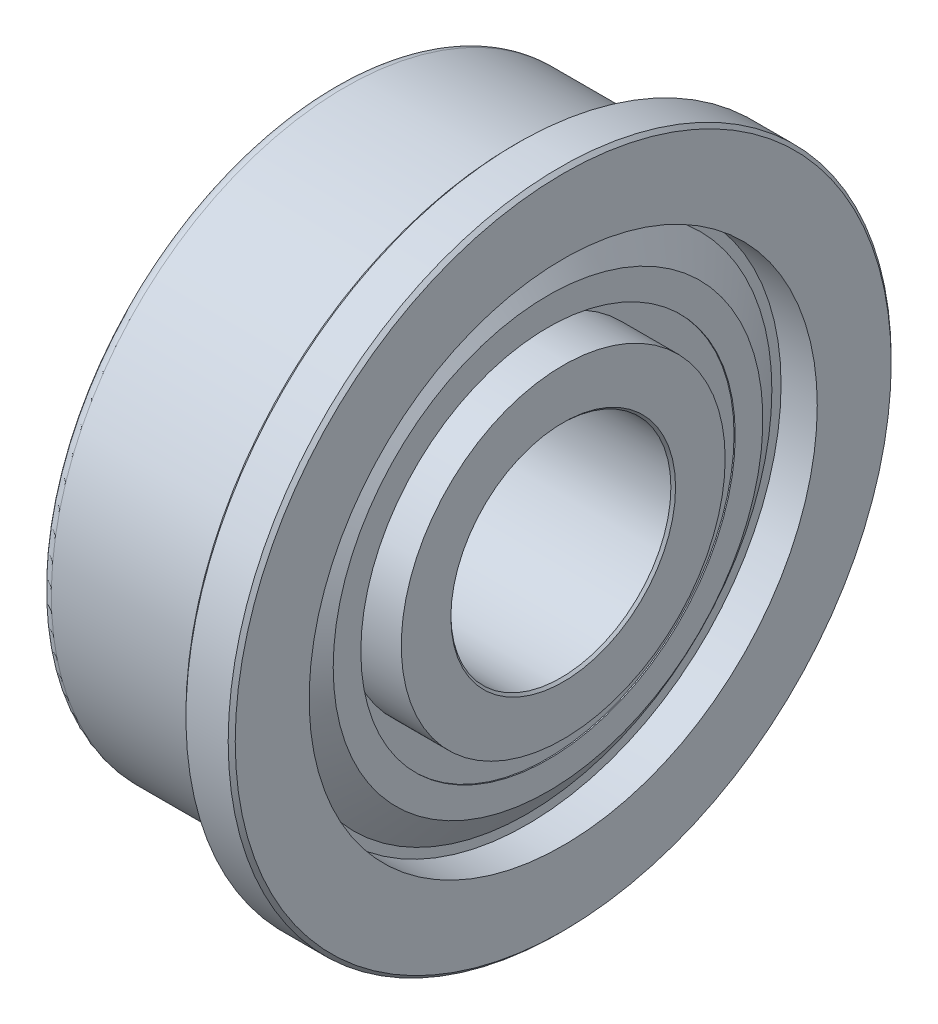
ISO-10303-21;
HEADER;
FILE_DESCRIPTION(('STEP AP214'),'2;1');
FILE_NAME('part.step','',(''),(''),'','','');
FILE_SCHEMA(('AUTOMOTIVE_DESIGN { 1 0 10303 214 1 1 1 1 }'));
ENDSEC;
DATA;
#1=APPLICATION_CONTEXT('core data for automotive mechanical design processes');
#2=APPLICATION_PROTOCOL_DEFINITION('international standard','automotive_design',2000,#1);
#3=PRODUCT_CONTEXT('',#1,'mechanical');
#4=PRODUCT('Part','Part','',(#3));
#5=PRODUCT_RELATED_PRODUCT_CATEGORY('part','',(#4));
#6=PRODUCT_DEFINITION_FORMATION('','',#4);
#7=PRODUCT_DEFINITION_CONTEXT('part definition',#1,'design');
#8=PRODUCT_DEFINITION('design','',#6,#7);
#9=PRODUCT_DEFINITION_SHAPE('','',#8);
#10=(LENGTH_UNIT() NAMED_UNIT(*) SI_UNIT(.MILLI.,.METRE.));
#11=(NAMED_UNIT(*) PLANE_ANGLE_UNIT() SI_UNIT($,.RADIAN.));
#12=(NAMED_UNIT(*) SI_UNIT($,.STERADIAN.) SOLID_ANGLE_UNIT());
#13=UNCERTAINTY_MEASURE_WITH_UNIT(LENGTH_MEASURE(1.E-05),#10,'distance_accuracy_value','');
#14=(GEOMETRIC_REPRESENTATION_CONTEXT(3) GLOBAL_UNCERTAINTY_ASSIGNED_CONTEXT((#13)) GLOBAL_UNIT_ASSIGNED_CONTEXT((#10,
#11,#12)) REPRESENTATION_CONTEXT('',''));
#15=CARTESIAN_POINT('',(0.,0.,0.));
#16=DIRECTION('',(0.,0.,1.));
#17=DIRECTION('',(1.,0.,0.));
#18=AXIS2_PLACEMENT_3D('',#15,#16,#17);
#19=CARTESIAN_POINT('',(2.48919999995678,0.,0.));
#20=DIRECTION('',(1.,0.,0.));
#21=DIRECTION('',(0.,0.,-1.));
#22=AXIS2_PLACEMENT_3D('',#19,#20,#21);
#23=CONICAL_SURFACE('',#22,2.43205000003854,0.785398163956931);
#24=CARTESIAN_POINT('',(2.48919999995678,0.,0.));
#25=DIRECTION('',(1.,0.,0.));
#26=DIRECTION('',(0.,0.,-1.));
#27=AXIS2_PLACEMENT_3D('',#24,#25,#26);
#28=CIRCLE('',#27,2.43205000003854);
#29=CARTESIAN_POINT('',(2.48919999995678,0.,-2.43205000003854));
#30=VERTEX_POINT('',#29);
#31=EDGE_CURVE('E47',#30,#30,#28,.F.);
#32=ORIENTED_EDGE('',*,*,#31,.F.);
#33=EDGE_LOOP('',(#32));
#34=FACE_BOUND('',#33,.T.);
#35=CARTESIAN_POINT('',(2.4384,0.,0.));
#36=DIRECTION('',(1.,0.,0.));
#37=DIRECTION('',(0.,0.,-1.));
#38=AXIS2_PLACEMENT_3D('',#35,#36,#37);
#39=CIRCLE('',#38,2.38125);
#40=CARTESIAN_POINT('',(2.4384,0.,-2.38125));
#41=VERTEX_POINT('',#40);
#42=EDGE_CURVE('E50',#41,#41,#39,.F.);
#43=ORIENTED_EDGE('',*,*,#42,.T.);
#44=EDGE_LOOP('',(#43));
#45=FACE_BOUND('',#44,.T.);
#46=ADVANCED_FACE('F16',(#34,#45),#23,.F.);
#47=CARTESIAN_POINT('',(2.4892,0.,0.));
#48=DIRECTION('',(1.,0.,0.));
#49=DIRECTION('',(0.,0.,-1.));
#50=AXIS2_PLACEMENT_3D('',#47,#48,#49);
#51=PLANE('',#50);
#52=ORIENTED_EDGE('',*,*,#31,.T.);
#53=EDGE_LOOP('',(#52));
#54=FACE_BOUND('',#53,.T.);
#55=CARTESIAN_POINT('',(2.4892,0.,0.));
#56=DIRECTION('',(1.,0.,0.));
#57=DIRECTION('',(0.,0.,-1.));
#58=AXIS2_PLACEMENT_3D('',#55,#56,#57);
#59=CIRCLE('',#58,3.5052);
#60=CARTESIAN_POINT('',(2.4892,0.,-3.5052));
#61=VERTEX_POINT('',#60);
#62=EDGE_CURVE('E51',#61,#61,#59,.F.);
#63=ORIENTED_EDGE('',*,*,#62,.F.);
#64=EDGE_LOOP('',(#63));
#65=FACE_BOUND('',#64,.T.);
#66=ADVANCED_FACE('F290',(#54,#65),#51,.T.);
#67=CARTESIAN_POINT('',(-2.73812,0.,0.));
#68=DIRECTION('',(1.,0.,0.));
#69=DIRECTION('',(0.,0.,-1.));
#70=AXIS2_PLACEMENT_3D('',#67,#68,#69);
#71=CYLINDRICAL_SURFACE('',#70,2.38125);
#72=ORIENTED_EDGE('',*,*,#42,.F.);
#73=EDGE_LOOP('',(#72));
#74=FACE_BOUND('',#73,.T.);
#75=CARTESIAN_POINT('',(-2.43839999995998,0.,0.));
#76=DIRECTION('',(-1.,0.,0.));
#77=DIRECTION('',(0.,1.,0.));
#78=AXIS2_PLACEMENT_3D('',#75,#76,#77);
#79=CIRCLE('',#78,2.3812499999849);
#80=CARTESIAN_POINT('',(-2.43839999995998,2.3812499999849,0.));
#81=VERTEX_POINT('',#80);
#82=EDGE_CURVE('E54',#81,#81,#79,.T.);
#83=ORIENTED_EDGE('',*,*,#82,.T.);
#84=EDGE_LOOP('',(#83));
#85=FACE_BOUND('',#84,.T.);
#86=ADVANCED_FACE('F287',(#74,#85),#71,.F.);
#87=CARTESIAN_POINT('',(-2.73812,0.,0.));
#88=DIRECTION('',(1.,0.,0.));
#89=DIRECTION('',(0.,0.,-1.));
#90=AXIS2_PLACEMENT_3D('',#87,#88,#89);
#91=CYLINDRICAL_SURFACE('',#90,3.5052);
#92=CARTESIAN_POINT('',(1.2446,0.,0.));
#93=DIRECTION('',(1.,0.,0.));
#94=DIRECTION('',(0.,0.,-1.));
#95=AXIS2_PLACEMENT_3D('',#92,#93,#94);
#96=CIRCLE('',#95,3.5052);
#97=CARTESIAN_POINT('',(1.2446,0.,-3.5052));
#98=VERTEX_POINT('',#97);
#99=EDGE_CURVE('E55',#98,#98,#96,.F.);
#100=ORIENTED_EDGE('',*,*,#99,.F.);
#101=EDGE_LOOP('',(#100));
#102=FACE_BOUND('',#101,.T.);
#103=ORIENTED_EDGE('',*,*,#62,.T.);
#104=EDGE_LOOP('',(#103));
#105=FACE_BOUND('',#104,.T.);
#106=ADVANCED_FACE('F283',(#102,#105),#91,.T.);
#107=CARTESIAN_POINT('',(-2.48919999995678,0.,0.));
#108=DIRECTION('',(-1.,0.,0.));
#109=DIRECTION('',(0.,0.,1.));
#110=AXIS2_PLACEMENT_3D('',#107,#108,#109);
#111=CONICAL_SURFACE('',#110,2.43205000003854,0.785398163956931);
#112=ORIENTED_EDGE('',*,*,#82,.F.);
#113=EDGE_LOOP('',(#112));
#114=FACE_BOUND('',#113,.T.);
#115=CARTESIAN_POINT('',(-2.48919999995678,0.,0.));
#116=DIRECTION('',(-1.,0.,0.));
#117=DIRECTION('',(0.,0.,1.));
#118=AXIS2_PLACEMENT_3D('',#115,#116,#117);
#119=CIRCLE('',#118,2.43205000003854);
#120=CARTESIAN_POINT('',(-2.48919999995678,0.,2.43205000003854));
#121=VERTEX_POINT('',#120);
#122=EDGE_CURVE('E58',#121,#121,#119,.T.);
#123=ORIENTED_EDGE('',*,*,#122,.T.);
#124=EDGE_LOOP('',(#123));
#125=FACE_BOUND('',#124,.T.);
#126=ADVANCED_FACE('F279',(#114,#125),#111,.F.);
#127=CARTESIAN_POINT('',(1.2446,0.,0.));
#128=DIRECTION('',(1.,0.,0.));
#129=DIRECTION('',(0.,0.,-1.));
#130=AXIS2_PLACEMENT_3D('',#127,#128,#129);
#131=PLANE('',#130);
#132=ORIENTED_EDGE('',*,*,#99,.T.);
#133=EDGE_LOOP('',(#132));
#134=FACE_BOUND('',#133,.T.);
#135=CARTESIAN_POINT('',(1.2446,0.,0.));
#136=DIRECTION('',(1.,0.,0.));
#137=DIRECTION('',(0.,0.,-1.));
#138=AXIS2_PLACEMENT_3D('',#135,#136,#137);
#139=CIRCLE('',#138,5.4991);
#140=CARTESIAN_POINT('',(1.2446,0.,-5.4991));
#141=VERTEX_POINT('',#140);
#142=EDGE_CURVE('E61',#141,#141,#139,.T.);
#143=ORIENTED_EDGE('',*,*,#142,.T.);
#144=EDGE_LOOP('',(#143));
#145=FACE_BOUND('',#144,.T.);
#146=ADVANCED_FACE('F275',(#134,#145),#131,.T.);
#147=CARTESIAN_POINT('',(-2.4892,0.,0.));
#148=DIRECTION('',(1.,0.,0.));
#149=DIRECTION('',(0.,0.,-1.));
#150=AXIS2_PLACEMENT_3D('',#147,#148,#149);
#151=PLANE('',#150);
#152=ORIENTED_EDGE('',*,*,#122,.F.);
#153=EDGE_LOOP('',(#152));
#154=FACE_BOUND('',#153,.T.);
#155=CARTESIAN_POINT('',(-2.4892,0.,0.));
#156=DIRECTION('',(1.,0.,0.));
#157=DIRECTION('',(0.,0.,-1.));
#158=AXIS2_PLACEMENT_3D('',#155,#156,#157);
#159=CIRCLE('',#158,3.5052);
#160=CARTESIAN_POINT('',(-2.4892,0.,-3.5052));
#161=VERTEX_POINT('',#160);
#162=EDGE_CURVE('E64',#161,#161,#159,.T.);
#163=ORIENTED_EDGE('',*,*,#162,.F.);
#164=EDGE_LOOP('',(#163));
#165=FACE_BOUND('',#164,.T.);
#166=ADVANCED_FACE('F271',(#154,#165),#151,.F.);
#167=CARTESIAN_POINT('',(-2.73812,0.,0.));
#168=DIRECTION('',(1.,0.,0.));
#169=DIRECTION('',(0.,0.,-1.));
#170=AXIS2_PLACEMENT_3D('',#167,#168,#169);
#171=CYLINDRICAL_SURFACE('',#170,5.4991);
#172=ORIENTED_EDGE('',*,*,#142,.F.);
#173=EDGE_LOOP('',(#172));
#174=FACE_BOUND('',#173,.T.);
#175=CARTESIAN_POINT('',(1.68021,0.,0.));
#176=DIRECTION('',(1.,0.,0.));
#177=DIRECTION('',(0.,0.,-1.));
#178=AXIS2_PLACEMENT_3D('',#175,#176,#177);
#179=CIRCLE('',#178,5.4991);
#180=CARTESIAN_POINT('',(1.68021,0.,-5.4991));
#181=VERTEX_POINT('',#180);
#182=EDGE_CURVE('E67',#181,#181,#179,.T.);
#183=ORIENTED_EDGE('',*,*,#182,.T.);
#184=EDGE_LOOP('',(#183));
#185=FACE_BOUND('',#184,.T.);
#186=ADVANCED_FACE('F267',(#174,#185),#171,.F.);
#187=CARTESIAN_POINT('',(-2.73812,0.,0.));
#188=DIRECTION('',(1.,0.,0.));
#189=DIRECTION('',(0.,0.,-1.));
#190=AXIS2_PLACEMENT_3D('',#187,#188,#189);
#191=CYLINDRICAL_SURFACE('',#190,3.5052);
#192=ORIENTED_EDGE('',*,*,#162,.T.);
#193=EDGE_LOOP('',(#192));
#194=FACE_BOUND('',#193,.T.);
#195=CARTESIAN_POINT('',(-1.2446,0.,0.));
#196=DIRECTION('',(1.,0.,0.));
#197=DIRECTION('',(0.,0.,-1.));
#198=AXIS2_PLACEMENT_3D('',#195,#196,#197);
#199=CIRCLE('',#198,3.5052);
#200=CARTESIAN_POINT('',(-1.2446,0.,-3.5052));
#201=VERTEX_POINT('',#200);
#202=EDGE_CURVE('E70',#201,#201,#199,.F.);
#203=ORIENTED_EDGE('',*,*,#202,.T.);
#204=EDGE_LOOP('',(#203));
#205=FACE_BOUND('',#204,.T.);
#206=ADVANCED_FACE('F263',(#194,#205),#191,.T.);
#207=CARTESIAN_POINT('',(1.68021,0.,0.));
#208=DIRECTION('',(1.,0.,0.));
#209=DIRECTION('',(0.,0.,-1.));
#210=AXIS2_PLACEMENT_3D('',#207,#208,#209);
#211=PLANE('',#210);
#212=CARTESIAN_POINT('',(1.68021000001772,0.,0.));
#213=DIRECTION('',(-1.,0.,0.));
#214=DIRECTION('',(0.,0.,1.));
#215=AXIS2_PLACEMENT_3D('',#212,#213,#214);
#216=CIRCLE('',#215,5.29170141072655);
#217=CARTESIAN_POINT('',(1.68021000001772,0.,5.29170141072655));
#218=VERTEX_POINT('',#217);
#219=EDGE_CURVE('E73',#218,#218,#216,.F.);
#220=ORIENTED_EDGE('',*,*,#219,.T.);
#221=EDGE_LOOP('',(#220));
#222=FACE_BOUND('',#221,.T.);
#223=ORIENTED_EDGE('',*,*,#182,.F.);
#224=EDGE_LOOP('',(#223));
#225=FACE_BOUND('',#224,.T.);
#226=ADVANCED_FACE('F259',(#222,#225),#211,.F.);
#227=CARTESIAN_POINT('',(-1.2446,0.,0.));
#228=DIRECTION('',(1.,0.,0.));
#229=DIRECTION('',(0.,0.,-1.));
#230=AXIS2_PLACEMENT_3D('',#227,#228,#229);
#231=PLANE('',#230);
#232=ORIENTED_EDGE('',*,*,#202,.F.);
#233=EDGE_LOOP('',(#232));
#234=FACE_BOUND('',#233,.T.);
#235=CARTESIAN_POINT('',(-1.2446,0.,0.));
#236=DIRECTION('',(1.,0.,0.));
#237=DIRECTION('',(0.,0.,-1.));
#238=AXIS2_PLACEMENT_3D('',#235,#236,#237);
#239=CIRCLE('',#238,5.4991);
#240=CARTESIAN_POINT('',(-1.2446,0.,-5.4991));
#241=VERTEX_POINT('',#240);
#242=EDGE_CURVE('E76',#241,#241,#239,.F.);
#243=ORIENTED_EDGE('',*,*,#242,.T.);
#244=EDGE_LOOP('',(#243));
#245=FACE_BOUND('',#244,.T.);
#246=ADVANCED_FACE('F255',(#234,#245),#231,.F.);
#247=CARTESIAN_POINT('',(1.68021000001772,0.,0.));
#248=DIRECTION('',(-1.,0.,0.));
#249=DIRECTION('',(0.,0.,1.));
#250=AXIS2_PLACEMENT_3D('',#247,#248,#249);
#251=CONICAL_SURFACE('',#250,5.29170141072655,0.959931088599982);
#252=ORIENTED_EDGE('',*,*,#219,.F.);
#253=EDGE_LOOP('',(#252));
#254=FACE_BOUND('',#253,.T.);
#255=CARTESIAN_POINT('',(2.1350683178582,0.,0.));
#256=DIRECTION('',(-1.,0.,0.));
#257=DIRECTION('',(0.,0.,1.));
#258=AXIS2_PLACEMENT_3D('',#255,#256,#257);
#259=CIRCLE('',#258,4.64209641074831);
#260=CARTESIAN_POINT('',(2.1350683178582,0.,4.64209641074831));
#261=VERTEX_POINT('',#260);
#262=EDGE_CURVE('E79',#261,#261,#259,.F.);
#263=ORIENTED_EDGE('',*,*,#262,.T.);
#264=EDGE_LOOP('',(#263));
#265=FACE_BOUND('',#264,.T.);
#266=ADVANCED_FACE('F251',(#254,#265),#251,.F.);
#267=CARTESIAN_POINT('',(-2.73812,0.,0.));
#268=DIRECTION('',(1.,0.,0.));
#269=DIRECTION('',(0.,0.,-1.));
#270=AXIS2_PLACEMENT_3D('',#267,#268,#269);
#271=CYLINDRICAL_SURFACE('',#270,5.4991);
#272=ORIENTED_EDGE('',*,*,#242,.F.);
#273=EDGE_LOOP('',(#272));
#274=FACE_BOUND('',#273,.T.);
#275=CARTESIAN_POINT('',(-1.68021,0.,0.));
#276=DIRECTION('',(1.,0.,0.));
#277=DIRECTION('',(0.,0.,-1.));
#278=AXIS2_PLACEMENT_3D('',#275,#276,#277);
#279=CIRCLE('',#278,5.4991);
#280=CARTESIAN_POINT('',(-1.68021,0.,-5.4991));
#281=VERTEX_POINT('',#280);
#282=EDGE_CURVE('E82',#281,#281,#279,.T.);
#283=ORIENTED_EDGE('',*,*,#282,.F.);
#284=EDGE_LOOP('',(#283));
#285=FACE_BOUND('',#284,.T.);
#286=ADVANCED_FACE('F247',(#274,#285),#271,.F.);
#287=CARTESIAN_POINT('',(2.13506831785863,0.,0.));
#288=DIRECTION('',(1.,0.,0.));
#289=DIRECTION('',(0.,0.,-1.));
#290=AXIS2_PLACEMENT_3D('',#287,#288,#289);
#291=PLANE('',#290);
#292=CARTESIAN_POINT('',(2.13506831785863,0.,0.));
#293=DIRECTION('',(1.,0.,0.));
#294=DIRECTION('',(0.,0.,-1.));
#295=AXIS2_PLACEMENT_3D('',#292,#293,#294);
#296=CIRCLE('',#295,4.051935);
#297=CARTESIAN_POINT('',(2.13506831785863,0.,-4.051935));
#298=VERTEX_POINT('',#297);
#299=EDGE_CURVE('E85',#298,#298,#296,.T.);
#300=ORIENTED_EDGE('',*,*,#299,.T.);
#301=EDGE_LOOP('',(#300));
#302=FACE_BOUND('',#301,.T.);
#303=ORIENTED_EDGE('',*,*,#262,.F.);
#304=EDGE_LOOP('',(#303));
#305=FACE_BOUND('',#304,.T.);
#306=ADVANCED_FACE('F243',(#302,#305),#291,.F.);
#307=CARTESIAN_POINT('',(-1.68021,0.,0.));
#308=DIRECTION('',(1.,0.,0.));
#309=DIRECTION('',(0.,0.,-1.));
#310=AXIS2_PLACEMENT_3D('',#307,#308,#309);
#311=PLANE('',#310);
#312=CARTESIAN_POINT('',(-1.68021000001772,0.,0.));
#313=DIRECTION('',(1.,0.,0.));
#314=DIRECTION('',(0.,0.,-1.));
#315=AXIS2_PLACEMENT_3D('',#312,#313,#314);
#316=CIRCLE('',#315,5.29170141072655);
#317=CARTESIAN_POINT('',(-1.68021000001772,0.,-5.29170141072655));
#318=VERTEX_POINT('',#317);
#319=EDGE_CURVE('E88',#318,#318,#316,.F.);
#320=ORIENTED_EDGE('',*,*,#319,.T.);
#321=EDGE_LOOP('',(#320));
#322=FACE_BOUND('',#321,.T.);
#323=ORIENTED_EDGE('',*,*,#282,.T.);
#324=EDGE_LOOP('',(#323));
#325=FACE_BOUND('',#324,.T.);
#326=ADVANCED_FACE('F239',(#322,#325),#311,.T.);
#327=CARTESIAN_POINT('',(1.65619708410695,0.,0.));
#328=DIRECTION('',(1.,0.,0.));
#329=DIRECTION('',(0.,0.,-1.));
#330=AXIS2_PLACEMENT_3D('',#327,#328,#329);
#331=CYLINDRICAL_SURFACE('',#330,4.051935);
#332=CARTESIAN_POINT('',(2.16046831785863,0.,0.));
#333=DIRECTION('',(1.,0.,0.));
#334=DIRECTION('',(0.,0.,-1.));
#335=AXIS2_PLACEMENT_3D('',#332,#333,#334);
#336=CIRCLE('',#335,4.051935);
#337=CARTESIAN_POINT('',(2.16046831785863,0.,-4.051935));
#338=VERTEX_POINT('',#337);
#339=EDGE_CURVE('E91',#338,#338,#336,.F.);
#340=ORIENTED_EDGE('',*,*,#339,.F.);
#341=EDGE_LOOP('',(#340));
#342=FACE_BOUND('',#341,.T.);
#343=ORIENTED_EDGE('',*,*,#299,.F.);
#344=EDGE_LOOP('',(#343));
#345=FACE_BOUND('',#344,.T.);
#346=ADVANCED_FACE('F235',(#342,#345),#331,.F.);
#347=CARTESIAN_POINT('',(-1.68021000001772,0.,0.));
#348=DIRECTION('',(1.,0.,0.));
#349=DIRECTION('',(0.,0.,-1.));
#350=AXIS2_PLACEMENT_3D('',#347,#348,#349);
#351=CONICAL_SURFACE('',#350,5.29170141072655,0.959931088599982);
#352=ORIENTED_EDGE('',*,*,#319,.F.);
#353=EDGE_LOOP('',(#352));
#354=FACE_BOUND('',#353,.T.);
#355=CARTESIAN_POINT('',(-2.1350683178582,0.,0.));
#356=DIRECTION('',(1.,0.,0.));
#357=DIRECTION('',(0.,0.,-1.));
#358=AXIS2_PLACEMENT_3D('',#355,#356,#357);
#359=CIRCLE('',#358,4.64209641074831);
#360=CARTESIAN_POINT('',(-2.1350683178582,0.,-4.64209641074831));
#361=VERTEX_POINT('',#360);
#362=EDGE_CURVE('E94',#361,#361,#359,.T.);
#363=ORIENTED_EDGE('',*,*,#362,.F.);
#364=EDGE_LOOP('',(#363));
#365=FACE_BOUND('',#364,.T.);
#366=ADVANCED_FACE('F231',(#354,#365),#351,.F.);
#367=CARTESIAN_POINT('',(2.16046831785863,0.,0.));
#368=DIRECTION('',(1.,0.,0.));
#369=DIRECTION('',(0.,0.,-1.));
#370=AXIS2_PLACEMENT_3D('',#367,#368,#369);
#371=PLANE('',#370);
#372=ORIENTED_EDGE('',*,*,#339,.T.);
#373=EDGE_LOOP('',(#372));
#374=FACE_BOUND('',#373,.T.);
#375=CARTESIAN_POINT('',(2.16046831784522,0.,0.));
#376=DIRECTION('',(-1.,0.,0.));
#377=DIRECTION('',(0.,0.,1.));
#378=AXIS2_PLACEMENT_3D('',#375,#376,#377);
#379=CIRCLE('',#378,4.65010500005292);
#380=CARTESIAN_POINT('',(2.16046831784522,0.,4.65010500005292));
#381=VERTEX_POINT('',#380);
#382=EDGE_CURVE('E97',#381,#381,#379,.T.);
#383=ORIENTED_EDGE('',*,*,#382,.F.);
#384=EDGE_LOOP('',(#383));
#385=FACE_BOUND('',#384,.T.);
#386=ADVANCED_FACE('F227',(#374,#385),#371,.T.);
#387=CARTESIAN_POINT('',(-2.13506831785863,0.,0.));
#388=DIRECTION('',(1.,0.,0.));
#389=DIRECTION('',(0.,0.,-1.));
#390=AXIS2_PLACEMENT_3D('',#387,#388,#389);
#391=PLANE('',#390);
#392=CARTESIAN_POINT('',(-2.13506831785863,0.,0.));
#393=DIRECTION('',(1.,0.,0.));
#394=DIRECTION('',(0.,0.,-1.));
#395=AXIS2_PLACEMENT_3D('',#392,#393,#394);
#396=CIRCLE('',#395,4.051935);
#397=CARTESIAN_POINT('',(-2.13506831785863,0.,-4.051935));
#398=VERTEX_POINT('',#397);
#399=EDGE_CURVE('E100',#398,#398,#396,.F.);
#400=ORIENTED_EDGE('',*,*,#399,.T.);
#401=EDGE_LOOP('',(#400));
#402=FACE_BOUND('',#401,.T.);
#403=ORIENTED_EDGE('',*,*,#362,.T.);
#404=EDGE_LOOP('',(#403));
#405=FACE_BOUND('',#404,.T.);
#406=ADVANCED_FACE('F223',(#402,#405),#391,.T.);
#407=CARTESIAN_POINT('',(1.70561000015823,0.,0.));
#408=DIRECTION('',(-1.,0.,0.));
#409=DIRECTION('',(0.,0.,1.));
#410=AXIS2_PLACEMENT_3D('',#407,#408,#409);
#411=CONICAL_SURFACE('',#410,5.29970999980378,0.959931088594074);
#412=CARTESIAN_POINT('',(1.70561000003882,0.,0.));
#413=DIRECTION('',(-1.,0.,0.));
#414=DIRECTION('',(0.,0.,1.));
#415=AXIS2_PLACEMENT_3D('',#412,#413,#414);
#416=CIRCLE('',#415,5.29970999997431);
#417=CARTESIAN_POINT('',(1.70561000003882,0.,5.29970999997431));
#418=VERTEX_POINT('',#417);
#419=EDGE_CURVE('E103',#418,#418,#416,.T.);
#420=ORIENTED_EDGE('',*,*,#419,.F.);
#421=EDGE_LOOP('',(#420));
#422=FACE_BOUND('',#421,.T.);
#423=ORIENTED_EDGE('',*,*,#382,.T.);
#424=EDGE_LOOP('',(#423));
#425=FACE_BOUND('',#424,.T.);
#426=ADVANCED_FACE('F219',(#422,#425),#411,.T.);
#427=CARTESIAN_POINT('',(-1.65619708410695,0.,0.));
#428=DIRECTION('',(1.,0.,0.));
#429=DIRECTION('',(0.,0.,-1.));
#430=AXIS2_PLACEMENT_3D('',#427,#428,#429);
#431=CYLINDRICAL_SURFACE('',#430,4.051935);
#432=CARTESIAN_POINT('',(-2.16046831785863,0.,0.));
#433=DIRECTION('',(1.,0.,0.));
#434=DIRECTION('',(0.,0.,-1.));
#435=AXIS2_PLACEMENT_3D('',#432,#433,#434);
#436=CIRCLE('',#435,4.051935);
#437=CARTESIAN_POINT('',(-2.16046831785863,0.,-4.051935));
#438=VERTEX_POINT('',#437);
#439=EDGE_CURVE('E106',#438,#438,#436,.F.);
#440=ORIENTED_EDGE('',*,*,#439,.T.);
#441=EDGE_LOOP('',(#440));
#442=FACE_BOUND('',#441,.T.);
#443=ORIENTED_EDGE('',*,*,#399,.F.);
#444=EDGE_LOOP('',(#443));
#445=FACE_BOUND('',#444,.T.);
#446=ADVANCED_FACE('F215',(#442,#445),#431,.F.);
#447=CARTESIAN_POINT('',(1.70561,0.,0.));
#448=DIRECTION('',(1.,0.,0.));
#449=DIRECTION('',(0.,0.,-1.));
#450=AXIS2_PLACEMENT_3D('',#447,#448,#449);
#451=PLANE('',#450);
#452=ORIENTED_EDGE('',*,*,#419,.T.);
#453=EDGE_LOOP('',(#452));
#454=FACE_BOUND('',#453,.T.);
#455=CARTESIAN_POINT('',(1.70561,0.,0.));
#456=DIRECTION('',(1.,0.,0.));
#457=DIRECTION('',(0.,0.,-1.));
#458=AXIS2_PLACEMENT_3D('',#455,#456,#457);
#459=CIRCLE('',#458,5.4991);
#460=CARTESIAN_POINT('',(1.70561,0.,-5.4991));
#461=VERTEX_POINT('',#460);
#462=EDGE_CURVE('E109',#461,#461,#459,.T.);
#463=ORIENTED_EDGE('',*,*,#462,.T.);
#464=EDGE_LOOP('',(#463));
#465=FACE_BOUND('',#464,.T.);
#466=ADVANCED_FACE('F211',(#454,#465),#451,.T.);
#467=CARTESIAN_POINT('',(-2.16046831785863,0.,0.));
#468=DIRECTION('',(1.,0.,0.));
#469=DIRECTION('',(0.,0.,-1.));
#470=AXIS2_PLACEMENT_3D('',#467,#468,#469);
#471=PLANE('',#470);
#472=ORIENTED_EDGE('',*,*,#439,.F.);
#473=EDGE_LOOP('',(#472));
#474=FACE_BOUND('',#473,.T.);
#475=CARTESIAN_POINT('',(-2.16046831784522,0.,0.));
#476=DIRECTION('',(1.,0.,0.));
#477=DIRECTION('',(0.,0.,-1.));
#478=AXIS2_PLACEMENT_3D('',#475,#476,#477);
#479=CIRCLE('',#478,4.65010500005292);
#480=CARTESIAN_POINT('',(-2.16046831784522,0.,-4.65010500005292));
#481=VERTEX_POINT('',#480);
#482=EDGE_CURVE('E112',#481,#481,#479,.T.);
#483=ORIENTED_EDGE('',*,*,#482,.F.);
#484=EDGE_LOOP('',(#483));
#485=FACE_BOUND('',#484,.T.);
#486=ADVANCED_FACE('F207',(#474,#485),#471,.F.);
#487=CARTESIAN_POINT('',(-2.73812,0.,0.));
#488=DIRECTION('',(1.,0.,0.));
#489=DIRECTION('',(0.,0.,-1.));
#490=AXIS2_PLACEMENT_3D('',#487,#488,#489);
#491=CYLINDRICAL_SURFACE('',#490,5.4991);
#492=CARTESIAN_POINT('',(2.4892,0.,0.));
#493=DIRECTION('',(1.,0.,0.));
#494=DIRECTION('',(0.,0.,-1.));
#495=AXIS2_PLACEMENT_3D('',#492,#493,#494);
#496=CIRCLE('',#495,5.4991);
#497=CARTESIAN_POINT('',(2.4892,0.,-5.4991));
#498=VERTEX_POINT('',#497);
#499=EDGE_CURVE('E115',#498,#498,#496,.F.);
#500=ORIENTED_EDGE('',*,*,#499,.F.);
#501=EDGE_LOOP('',(#500));
#502=FACE_BOUND('',#501,.T.);
#503=ORIENTED_EDGE('',*,*,#462,.F.);
#504=EDGE_LOOP('',(#503));
#505=FACE_BOUND('',#504,.T.);
#506=ADVANCED_FACE('F203',(#502,#505),#491,.F.);
#507=CARTESIAN_POINT('',(-1.70561000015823,0.,0.));
#508=DIRECTION('',(1.,0.,0.));
#509=DIRECTION('',(0.,0.,-1.));
#510=AXIS2_PLACEMENT_3D('',#507,#508,#509);
#511=CONICAL_SURFACE('',#510,5.29970999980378,0.959931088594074);
#512=CARTESIAN_POINT('',(-1.70561000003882,0.,0.));
#513=DIRECTION('',(1.,0.,0.));
#514=DIRECTION('',(0.,0.,-1.));
#515=AXIS2_PLACEMENT_3D('',#512,#513,#514);
#516=CIRCLE('',#515,5.29970999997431);
#517=CARTESIAN_POINT('',(-1.70561000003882,0.,-5.29970999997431));
#518=VERTEX_POINT('',#517);
#519=EDGE_CURVE('E118',#518,#518,#516,.F.);
#520=ORIENTED_EDGE('',*,*,#519,.T.);
#521=EDGE_LOOP('',(#520));
#522=FACE_BOUND('',#521,.T.);
#523=ORIENTED_EDGE('',*,*,#482,.T.);
#524=EDGE_LOOP('',(#523));
#525=FACE_BOUND('',#524,.T.);
#526=ADVANCED_FACE('F199',(#522,#525),#511,.T.);
#527=CARTESIAN_POINT('',(2.4892,0.,0.));
#528=DIRECTION('',(1.,0.,0.));
#529=DIRECTION('',(0.,0.,-1.));
#530=AXIS2_PLACEMENT_3D('',#527,#528,#529);
#531=PLANE('',#530);
#532=ORIENTED_EDGE('',*,*,#499,.T.);
#533=EDGE_LOOP('',(#532));
#534=FACE_BOUND('',#533,.T.);
#535=CARTESIAN_POINT('',(2.48920000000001,0.,0.));
#536=DIRECTION('',(-1.,0.,0.));
#537=DIRECTION('',(0.,0.,1.));
#538=AXIS2_PLACEMENT_3D('',#535,#536,#537);
#539=CIRCLE('',#538,7.09930000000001);
#540=CARTESIAN_POINT('',(2.48920000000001,0.,7.09930000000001));
#541=VERTEX_POINT('',#540);
#542=EDGE_CURVE('E121',#541,#541,#539,.T.);
#543=ORIENTED_EDGE('',*,*,#542,.F.);
#544=EDGE_LOOP('',(#543));
#545=FACE_BOUND('',#544,.T.);
#546=ADVANCED_FACE('F195',(#534,#545),#531,.T.);
#547=CARTESIAN_POINT('',(-1.70561,0.,0.));
#548=DIRECTION('',(1.,0.,0.));
#549=DIRECTION('',(0.,0.,-1.));
#550=AXIS2_PLACEMENT_3D('',#547,#548,#549);
#551=PLANE('',#550);
#552=ORIENTED_EDGE('',*,*,#519,.F.);
#553=EDGE_LOOP('',(#552));
#554=FACE_BOUND('',#553,.T.);
#555=CARTESIAN_POINT('',(-1.70561,0.,0.));
#556=DIRECTION('',(1.,0.,0.));
#557=DIRECTION('',(0.,0.,-1.));
#558=AXIS2_PLACEMENT_3D('',#555,#556,#557);
#559=CIRCLE('',#558,5.4991);
#560=CARTESIAN_POINT('',(-1.70561,0.,-5.4991));
#561=VERTEX_POINT('',#560);
#562=EDGE_CURVE('E124',#561,#561,#559,.F.);
#563=ORIENTED_EDGE('',*,*,#562,.T.);
#564=EDGE_LOOP('',(#563));
#565=FACE_BOUND('',#564,.T.);
#566=ADVANCED_FACE('F191',(#554,#565),#551,.F.);
#567=CARTESIAN_POINT('',(2.413,0.,0.));
#568=DIRECTION('',(-1.,0.,0.));
#569=DIRECTION('',(0.,0.,1.));
#570=AXIS2_PLACEMENT_3D('',#567,#568,#569);
#571=CONICAL_SURFACE('',#570,7.17549999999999,0.7853981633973);
#572=ORIENTED_EDGE('',*,*,#542,.T.);
#573=EDGE_LOOP('',(#572));
#574=FACE_BOUND('',#573,.T.);
#575=CARTESIAN_POINT('',(2.413,0.,0.));
#576=DIRECTION('',(1.,0.,0.));
#577=DIRECTION('',(0.,0.,-1.));
#578=AXIS2_PLACEMENT_3D('',#575,#576,#577);
#579=CIRCLE('',#578,7.1755);
#580=CARTESIAN_POINT('',(2.413,0.,-7.1755));
#581=VERTEX_POINT('',#580);
#582=EDGE_CURVE('E127',#581,#581,#579,.F.);
#583=ORIENTED_EDGE('',*,*,#582,.F.);
#584=EDGE_LOOP('',(#583));
#585=FACE_BOUND('',#584,.T.);
#586=ADVANCED_FACE('F187',(#574,#585),#571,.T.);
#587=CARTESIAN_POINT('',(-2.73812,0.,0.));
#588=DIRECTION('',(1.,0.,0.));
#589=DIRECTION('',(0.,0.,-1.));
#590=AXIS2_PLACEMENT_3D('',#587,#588,#589);
#591=CYLINDRICAL_SURFACE('',#590,5.4991);
#592=CARTESIAN_POINT('',(-2.4892,0.,0.));
#593=DIRECTION('',(1.,0.,0.));
#594=DIRECTION('',(0.,0.,-1.));
#595=AXIS2_PLACEMENT_3D('',#592,#593,#594);
#596=CIRCLE('',#595,5.4991);
#597=CARTESIAN_POINT('',(-2.4892,0.,-5.4991));
#598=VERTEX_POINT('',#597);
#599=EDGE_CURVE('E128',#598,#598,#596,.F.);
#600=ORIENTED_EDGE('',*,*,#599,.T.);
#601=EDGE_LOOP('',(#600));
#602=FACE_BOUND('',#601,.T.);
#603=ORIENTED_EDGE('',*,*,#562,.F.);
#604=EDGE_LOOP('',(#603));
#605=FACE_BOUND('',#604,.T.);
#606=ADVANCED_FACE('F183',(#602,#605),#591,.F.);
#607=CARTESIAN_POINT('',(-2.73812,0.,0.));
#608=DIRECTION('',(1.,0.,0.));
#609=DIRECTION('',(0.,0.,-1.));
#610=AXIS2_PLACEMENT_3D('',#607,#608,#609);
#611=CYLINDRICAL_SURFACE('',#610,7.1755);
#612=ORIENTED_EDGE('',*,*,#582,.T.);
#613=EDGE_LOOP('',(#612));
#614=FACE_BOUND('',#613,.T.);
#615=CARTESIAN_POINT('',(1.49860000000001,0.,0.));
#616=DIRECTION('',(1.,0.,0.));
#617=DIRECTION('',(0.,-1.,0.));
#618=AXIS2_PLACEMENT_3D('',#615,#616,#617);
#619=CIRCLE('',#618,7.17549999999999);
#620=CARTESIAN_POINT('',(1.49860000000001,-7.17549999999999,0.));
#621=VERTEX_POINT('',#620);
#622=EDGE_CURVE('E45',#621,#621,#619,.F.);
#623=ORIENTED_EDGE('',*,*,#622,.F.);
#624=EDGE_LOOP('',(#623));
#625=FACE_BOUND('',#624,.T.);
#626=ADVANCED_FACE('F171',(#614,#625),#611,.T.);
#627=CARTESIAN_POINT('',(-2.4892,0.,0.));
#628=DIRECTION('',(1.,0.,0.));
#629=DIRECTION('',(0.,0.,-1.));
#630=AXIS2_PLACEMENT_3D('',#627,#628,#629);
#631=PLANE('',#630);
#632=ORIENTED_EDGE('',*,*,#599,.F.);
#633=EDGE_LOOP('',(#632));
#634=FACE_BOUND('',#633,.T.);
#635=CARTESIAN_POINT('',(-2.4892,0.,0.));
#636=DIRECTION('',(1.,0.,0.));
#637=DIRECTION('',(0.,-1.,0.));
#638=AXIS2_PLACEMENT_3D('',#635,#636,#637);
#639=CIRCLE('',#638,6.10108);
#640=CARTESIAN_POINT('',(-2.4892,-6.10108,0.));
#641=VERTEX_POINT('',#640);
#642=CARTESIAN_POINT('',(-2.4892,6.10108,0.));
#643=VERTEX_POINT('',#642);
#644=EDGE_CURVE('E33',#641,#643,#639,.T.);
#645=ORIENTED_EDGE('',*,*,#644,.F.);
#646=CARTESIAN_POINT('',(-2.4892,0.,0.));
#647=DIRECTION('',(1.,0.,0.));
#648=DIRECTION('',(0.,1.,0.));
#649=AXIS2_PLACEMENT_3D('',#646,#647,#648);
#650=CIRCLE('',#649,6.10108);
#651=EDGE_CURVE('E36',#643,#641,#650,.T.);
#652=ORIENTED_EDGE('',*,*,#651,.F.);
#653=EDGE_LOOP('',(#645,#652));
#654=FACE_BOUND('',#653,.T.);
#655=ADVANCED_FACE('F38',(#634,#654),#631,.F.);
#656=CARTESIAN_POINT('',(1.49860000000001,0.,0.));
#657=DIRECTION('',(1.,0.,0.));
#658=DIRECTION('',(0.,0.,-1.));
#659=AXIS2_PLACEMENT_3D('',#656,#657,#658);
#660=CONICAL_SURFACE('',#659,7.17549999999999,0.785398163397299);
#661=ORIENTED_EDGE('',*,*,#622,.T.);
#662=EDGE_LOOP('',(#661));
#663=FACE_BOUND('',#662,.T.);
#664=CARTESIAN_POINT('',(1.42239999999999,0.,0.));
#665=DIRECTION('',(1.,0.,0.));
#666=DIRECTION('',(0.,0.,-1.));
#667=AXIS2_PLACEMENT_3D('',#664,#665,#666);
#668=CIRCLE('',#667,7.09930000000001);
#669=CARTESIAN_POINT('',(1.42239999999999,0.,-7.09930000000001));
#670=VERTEX_POINT('',#669);
#671=EDGE_CURVE('E41',#670,#670,#668,.T.);
#672=ORIENTED_EDGE('',*,*,#671,.T.);
#673=EDGE_LOOP('',(#672));
#674=FACE_BOUND('',#673,.T.);
#675=ADVANCED_FACE('F154',(#663,#674),#660,.T.);
#676=CARTESIAN_POINT('',(-2.24028,0.,0.));
#677=DIRECTION('',(1.,0.,0.));
#678=DIRECTION('',(0.,-1.,0.));
#679=AXIS2_PLACEMENT_3D('',#676,#677,#678);
#680=TOROIDAL_SURFACE('',#679,6.10108,0.24892);
#681=CARTESIAN_POINT('',(-2.24028,0.,0.));
#682=DIRECTION('',(1.,0.,0.));
#683=DIRECTION('',(0.,0.,-1.));
#684=AXIS2_PLACEMENT_3D('',#681,#682,#683);
#685=CIRCLE('',#684,6.35);
#686=CARTESIAN_POINT('',(-2.24028,0.,-6.35));
#687=VERTEX_POINT('',#686);
#688=EDGE_CURVE('E26',#687,#687,#685,.T.);
#689=ORIENTED_EDGE('',*,*,#688,.F.);
#690=EDGE_LOOP('',(#689));
#691=FACE_BOUND('',#690,.T.);
#692=ORIENTED_EDGE('',*,*,#651,.T.);
#693=ORIENTED_EDGE('',*,*,#644,.T.);
#694=EDGE_LOOP('',(#692,#693));
#695=FACE_BOUND('',#694,.T.);
#696=ADVANCED_FACE('F44',(#691,#695),#680,.T.);
#697=CARTESIAN_POINT('',(1.4224,0.,0.));
#698=DIRECTION('',(1.,0.,0.));
#699=DIRECTION('',(0.,0.,-1.));
#700=AXIS2_PLACEMENT_3D('',#697,#698,#699);
#701=PLANE('',#700);
#702=CARTESIAN_POINT('',(1.4224,0.,0.));
#703=DIRECTION('',(1.,0.,0.));
#704=DIRECTION('',(0.,0.,-1.));
#705=AXIS2_PLACEMENT_3D('',#702,#703,#704);
#706=CIRCLE('',#705,6.35);
#707=CARTESIAN_POINT('',(1.4224,0.,-6.35));
#708=VERTEX_POINT('',#707);
#709=EDGE_CURVE('E10',#708,#708,#706,.F.);
#710=ORIENTED_EDGE('',*,*,#709,.F.);
#711=EDGE_LOOP('',(#710));
#712=FACE_BOUND('',#711,.T.);
#713=ORIENTED_EDGE('',*,*,#671,.F.);
#714=EDGE_LOOP('',(#713));
#715=FACE_BOUND('',#714,.T.);
#716=ADVANCED_FACE('F153',(#712,#715),#701,.F.);
#717=CARTESIAN_POINT('',(-2.73812,0.,0.));
#718=DIRECTION('',(1.,0.,0.));
#719=DIRECTION('',(0.,0.,-1.));
#720=AXIS2_PLACEMENT_3D('',#717,#718,#719);
#721=CYLINDRICAL_SURFACE('',#720,6.35);
#722=ORIENTED_EDGE('',*,*,#709,.T.);
#723=EDGE_LOOP('',(#722));
#724=FACE_BOUND('',#723,.T.);
#725=ORIENTED_EDGE('',*,*,#688,.T.);
#726=EDGE_LOOP('',(#725));
#727=FACE_BOUND('',#726,.T.);
#728=ADVANCED_FACE('F300',(#724,#727),#721,.T.);
#729=CLOSED_SHELL('',(#46,#66,#86,#106,#126,#146,#166,#186,#206,#226,#246,#266,#286,#306,#326,
#346,#366,#386,#406,#426,#446,#466,#486,#506,#526,#546,#566,#586,#606,#626,#655,#675,#696,#716,#728));
#730=MANIFOLD_SOLID_BREP('B1',#729);
#731=ADVANCED_BREP_SHAPE_REPRESENTATION('',(#18,#730),#14);
#732=SHAPE_DEFINITION_REPRESENTATION(#9,#731);
ENDSEC;
END-ISO-10303-21;
